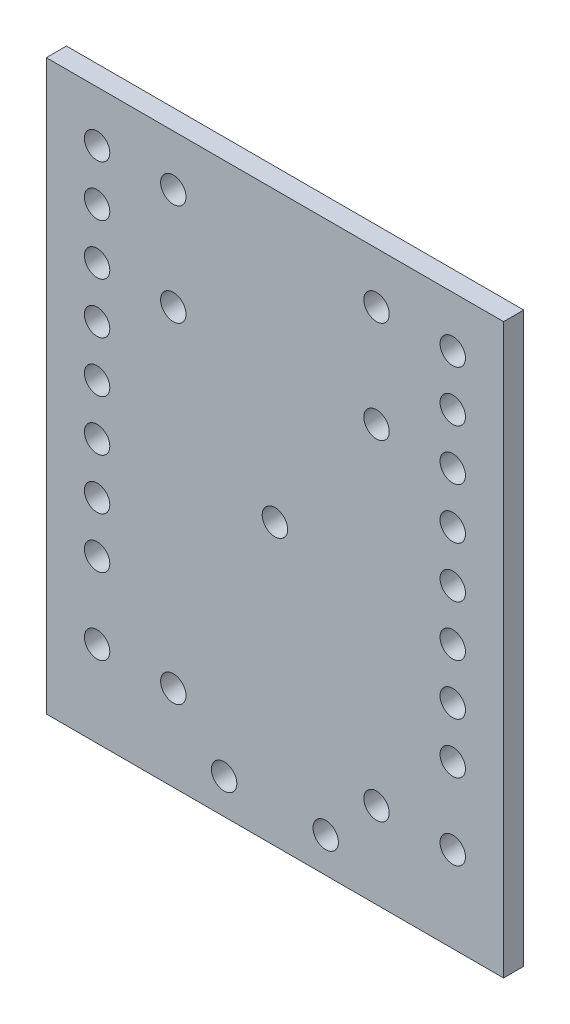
from build123d import *

# Parameters (mm, degrees)
SKETCH1_W               = 72
SKETCH1_H               = 72
BOSS_EXTRUDE1_DEPTH     = 1.5875
SKETCH2_R               = 2
CUT_EXTRUDE1_DEPTH      = 51.936432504
CUT_EXTRUDE2_DEPTH      = 51.936432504
CUT_EXTRUDE2_DEPTH_BACK = 51.936432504
SKETCH3_R               = 2
SKETCH4_W               = 72
SKETCH4_H               = 12
BOSS_EXTRUDE2_DEPTH     = 1.5875
CUT_EXTRUDE4_DEPTH      = 61.020997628
CUT_EXTRUDE4_DEPTH_BACK = 61.020997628
SKETCH6_R               = 2
SKETCH8_W               = 72
SKETCH8_H               = 5.5
BOSS_EXTRUDE3_DEPTH     = 1.5875
SKETCH9_R               = 2
CUT_EXTRUDE6_DEPTH      = 65.562610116


with BuildPart() as part:
    # Sketch1 → Boss-Extrude1 (new, symmetric)
    with BuildSketch(Plane.XY):
        Rectangle(SKETCH1_W, SKETCH1_H)
    extrude(amount=BOSS_EXTRUDE1_DEPTH, both=True)

    # Sketch2 → Cut-Extrude1 (cut, symmetric)
    with BuildSketch(Plane.XY):
        with Locations((-28, 28)):
            Circle(SKETCH2_R)
        with Locations((-16, 28)):
            Circle(SKETCH2_R)
        with Locations((-28, 20)):
            Circle(SKETCH2_R)
        with Locations((-28, 12)):
            Circle(SKETCH2_R)
        with Locations((-28, 4)):
            Circle(SKETCH2_R)
        with Locations((-28, -4)):
            Circle(SKETCH2_R)
        with Locations((-28, -12)):
            Circle(SKETCH2_R)
        with Locations((-28, -20)):
            Circle(SKETCH2_R)
        with Locations((-28, -28)):
            Circle(SKETCH2_R)
        with Locations((-16, 12)):
            Circle(SKETCH2_R)
    cut_extrude1 = extrude(amount=CUT_EXTRUDE1_DEPTH, both=True, mode=Mode.SUBTRACT)

    # Sketch3 → Cut-Extrude2 (cut, two sides: drawn at the far end of the back side and taken through both)
    with BuildSketch(Plane.XY.offset(-CUT_EXTRUDE2_DEPTH_BACK)):
        with Locations((0, -9.34223899)):
            Circle(SKETCH3_R)
    extrude(amount=CUT_EXTRUDE2_DEPTH + CUT_EXTRUDE2_DEPTH_BACK, mode=Mode.SUBTRACT)

    # Sketch4 → Boss-Extrude2 (add, symmetric)
    with BuildSketch(Plane.XY):
        with Locations((0, -42)):
            Rectangle(SKETCH4_W, SKETCH4_H)
    extrude(amount=BOSS_EXTRUDE2_DEPTH, both=True)

    # Sketch6 → Cut-Extrude4 (cut, two sides: drawn at the far end of the back side and taken through both)
    with BuildSketch(Plane.XY.offset(-CUT_EXTRUDE4_DEPTH_BACK)):
        with Locations((-28, -40)):
            Circle(SKETCH6_R)
        with Locations(Location((28, -40, 0), (0, 0, 180))):
            Circle(SKETCH6_R)
    extrude(amount=CUT_EXTRUDE4_DEPTH + CUT_EXTRUDE4_DEPTH_BACK, mode=Mode.SUBTRACT)

    # Sketch8 → Boss-Extrude3 (add, symmetric)
    with BuildSketch(Plane.XY):
        with Locations((0, -50.75)):
            Rectangle(SKETCH8_W, SKETCH8_H)
    extrude(amount=BOSS_EXTRUDE3_DEPTH, both=True)

    # Sketch9 → Cut-Extrude6 (cut, through all)
    with BuildSketch(Plane.XY.offset(1.5875)):
        with Locations((-8, -48)):
            Circle(SKETCH9_R)
        with Locations((-16, -40)):
            Circle(SKETCH9_R)
    cut_extrude6 = extrude(amount=-CUT_EXTRUDE6_DEPTH, mode=Mode.SUBTRACT)

    # Mirror1: Cut-Extrude1, Cut-Extrude6 across plane
    add(cut_extrude1.mirror(Plane(origin=(0, 0, 0), x_dir=(0, 0, 1), z_dir=(1, 0, 0))), mode=Mode.SUBTRACT)
    add(cut_extrude6.mirror(Plane(origin=(0, 0, 0), x_dir=(0, 0, 1), z_dir=(1, 0, 0))), mode=Mode.SUBTRACT)


solid = part.part
